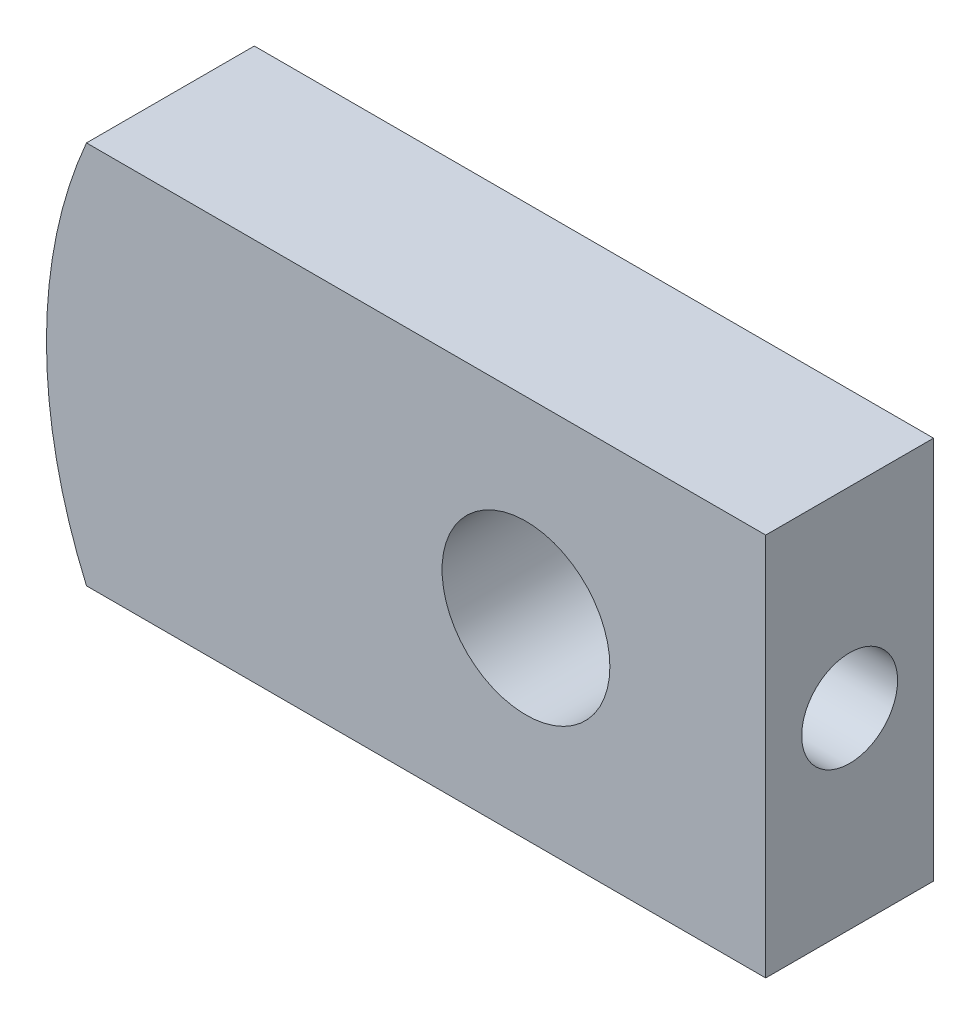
from build123d import *

# Parameters (mm, degrees)
BASE_EXTRUSION_DEPTH    = 7
ESQUISSE2_R             = 3.5
ENL_V_MAT_EXTRU_1_DEPTH = 23.649503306
ENL_V_MAT_EXTRU_2_REACH = 33.828
ESQUISSE3_R             = 2


with BuildPart() as part:
    # Esquisse1 → Base-Extrusion (new body)
    with BuildSketch(Plane.XY):
        with BuildLine():
            Line((-18.33030278, 8), (10, 8))
            Line((10, 8), (10, -8))
            Line((10, -8), (-18.33030278, -8))
            ThreePointArc((-18.33030278, -8), (-20, 0), (-18.33030278, 8))
        make_face()
    extrude(amount=BASE_EXTRUSION_DEPTH)

    # Esquisse2 → Enl_v. mat.-Extru.1 (cut, through all)
    with BuildSketch(Plane.XY.offset(7)):
        Circle(ESQUISSE2_R)
    extrude(amount=-ENL_V_MAT_EXTRU_1_DEPTH, mode=Mode.SUBTRACT)

    # Esquisse3 → Enl_v. mat.-Extru.2 (cut, up to next)
    with BuildSketch(Plane(origin=(10, 0, 0), x_dir=(0, 0, -1), z_dir=(1, 0, 0)), mode=Mode.PRIVATE) as enl_v_mat_extru_2_sk1:
        with Locations((-3.5, 0)):
            Circle(ESQUISSE3_R)
    enl_v_mat_extru_2_tool1 = extrude(enl_v_mat_extru_2_sk1.sketch, amount=-ENL_V_MAT_EXTRU_2_REACH, mode=Mode.PRIVATE) & part.part
    add(enl_v_mat_extru_2_tool1.solids().sort_by_distance((10, 0, 3.5))[0], mode=Mode.SUBTRACT)


solid = part.part
